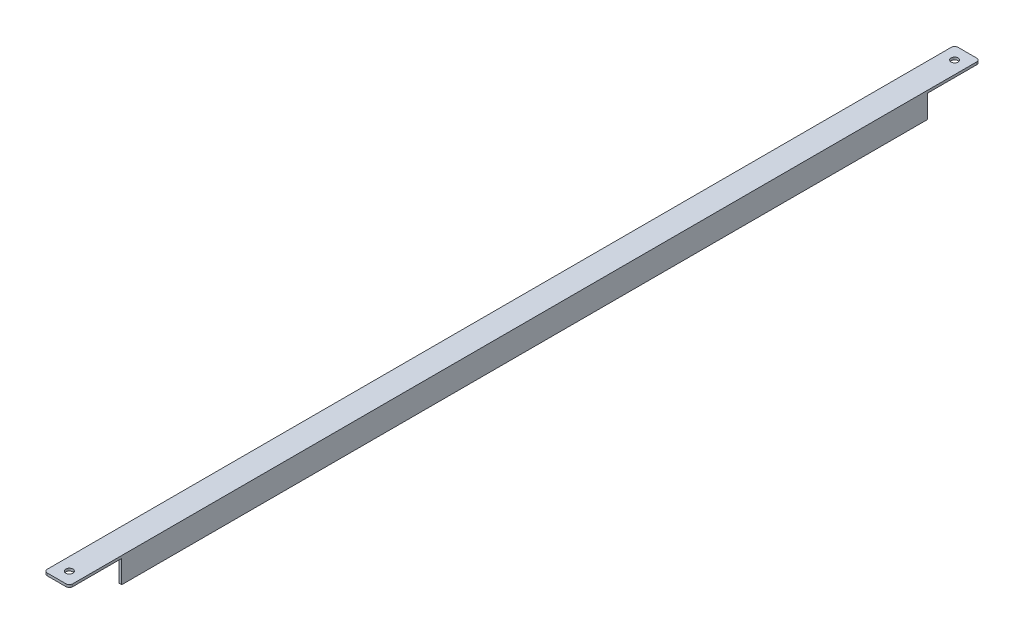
from build123d import *

# Parameters (mm, degrees)
SKETCH2_W           = 30
SKETCH2_H           = 30
BOSS_EXTRUDE1_DEPTH = 539
SKETCH3_W           = 24
SKETCH3_H           = 27
CUT_EXTRUDE1_DEPTH  = 1079.20869965
SKETCH4_W           = 62
SKETCH4_H           = 27
CUT_EXTRUDE2_DEPTH  = 541.042590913
SKETCH5_R           = 4.25
CUT_EXTRUDE3_DEPTH  = 541.042590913
FILLET1_R           = 4


with BuildPart() as part:
    # Sketch2 → Boss-Extrude1 (new, symmetric)
    with BuildSketch(Plane.XY):
        Rectangle(SKETCH2_W, SKETCH2_H)
    extrude(amount=BOSS_EXTRUDE1_DEPTH, both=True)

    # Sketch3 → Cut-Extrude1 (cut, through all)
    with BuildSketch(Plane.XY.offset(539)):
        with Locations((0, -1.5)):
            Rectangle(SKETCH3_W, SKETCH3_H)
    extrude(amount=-CUT_EXTRUDE1_DEPTH, mode=Mode.SUBTRACT)

    # Sketch4 → Cut-Extrude2 (cut, through all)
    with BuildSketch(Plane(origin=(15, 0, 0), x_dir=(0, 0, -1), z_dir=(1, 0, 0))):
        with Locations((508, -1.5)):
            Rectangle(SKETCH4_W, SKETCH4_H)
    cut_extrude2 = extrude(amount=-CUT_EXTRUDE2_DEPTH, mode=Mode.SUBTRACT)

    # Mirror1: Cut-Extrude2 across plane
    add(cut_extrude2.mirror(Plane.XY), mode=Mode.SUBTRACT)

    # Sketch5 → Cut-Extrude3 (cut, through all)
    with BuildSketch(Plane(origin=(0, 15, 0), x_dir=(1, 0, 0), z_dir=(0, 1, 0))):
        with Locations(Location((0, 524, 0), (0, 0, 270))):
            Circle(SKETCH5_R)
    cut_extrude3 = extrude(amount=-CUT_EXTRUDE3_DEPTH, mode=Mode.SUBTRACT)

    # Mirror2: Cut-Extrude3 across plane
    add(cut_extrude3.mirror(Plane.XY), mode=Mode.SUBTRACT)

    # Fillet1
    fillet1_edges = [part.edges().sort_by_distance(p)[0] for p in [
        (-15, 13.5, 539),
        (15, 13.5, -539),
        (-15, 13.5, -539),
        (15, 13.5, 539),
    ]]
    fillet(fillet1_edges, radius=FILLET1_R)


solid = part.part
